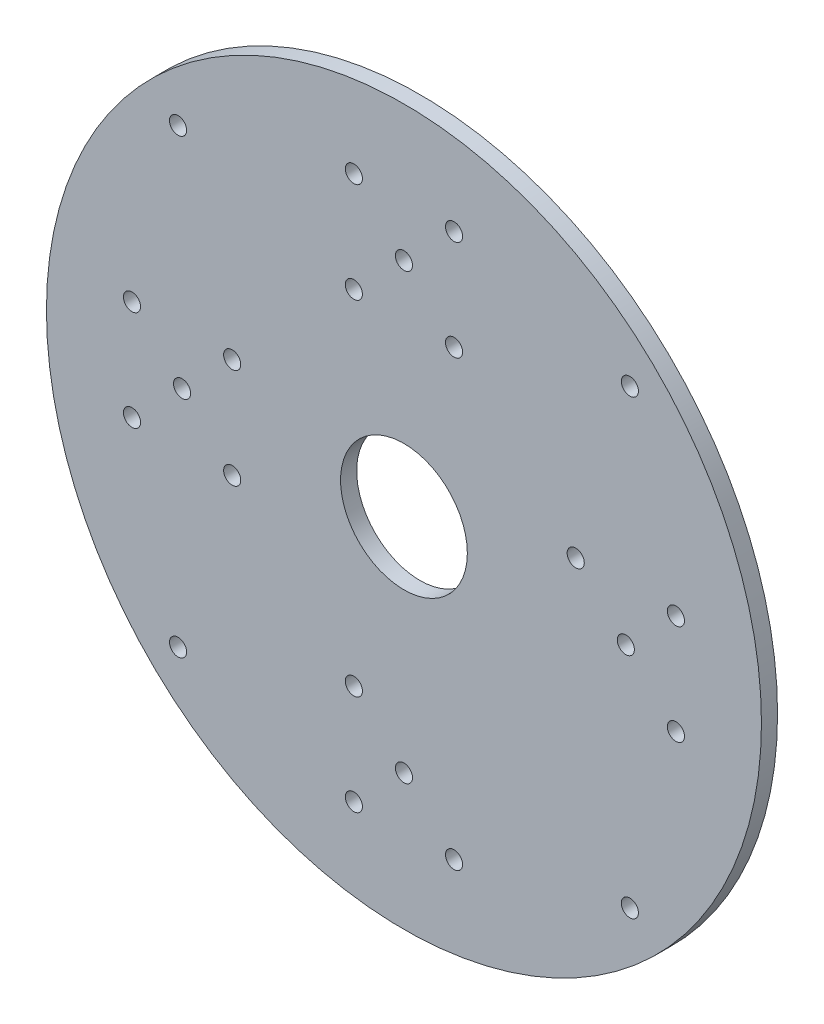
from build123d import *

# Parameters (mm, degrees)
SKETCH1_R           = 141
SKETCH1_R_2         = 3.3782
SKETCH1_R_3         = 25
BOSS_EXTRUDE1_DEPTH = 6.35


with BuildPart() as part:
    # Sketch1 → Boss-Extrude1 (new body)
    with BuildSketch(Plane(origin=(0, 0, 0), x_dir=(0, 1, 0), z_dir=(0, 0, 1))):
        with Locations(Location((0, 0, 0), (0, 0, 270))):
            Circle(SKETCH1_R)
        with Locations(Location((0, 87.5, 0), (0, 0, 270))):
            Circle(SKETCH1_R_2, mode=Mode.SUBTRACT)
        with Locations(Location((87.5, 0, 0), (0, 0, 270))):
            Circle(SKETCH1_R_2, mode=Mode.SUBTRACT)
        with Locations(Location((0, -87.5, 0), (0, 0, 270))):
            Circle(SKETCH1_R_2, mode=Mode.SUBTRACT)
        with Locations(Location((-87.5, 0, 0), (0, 0, 270))):
            Circle(SKETCH1_R_2, mode=Mode.SUBTRACT)
        with Locations(Location((-89.09545443, 89.09545443, 0), (0, 0, 270))):
            Circle(SKETCH1_R_2, mode=Mode.SUBTRACT)
        with Locations(Location((89.09545443, 89.09545443, 0), (0, 0, 270))):
            Circle(SKETCH1_R_2, mode=Mode.SUBTRACT)
        with Locations(Location((89.09545443, -89.09545443, 0), (0, 0, 270))):
            Circle(SKETCH1_R_2, mode=Mode.SUBTRACT)
        with Locations(Location((-89.09545443, -89.09545443, 0), (0, 0, 270))):
            Circle(SKETCH1_R_2, mode=Mode.SUBTRACT)
        with Locations(Location((0, 0, 0), (0, 0, 270))):
            Circle(SKETCH1_R_3, mode=Mode.SUBTRACT)
        with Locations(Location((-19.756563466, 67.743436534, 0), (0, 0, 270))):
            Circle(SKETCH1_R_2, mode=Mode.SUBTRACT)
        with Locations(Location((-19.756563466, 107.256563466, 0), (0, 0, 270))):
            Circle(SKETCH1_R_2, mode=Mode.SUBTRACT)
        with Locations(Location((19.756563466, 107.256563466, 0), (0, 0, 270))):
            Circle(SKETCH1_R_2, mode=Mode.SUBTRACT)
        with Locations(Location((19.756563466, 67.743436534, 0), (0, 0, 270))):
            Circle(SKETCH1_R_2, mode=Mode.SUBTRACT)
        with Locations(Location((107.256563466, 19.756563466, 0), (0, 0, 270))):
            Circle(SKETCH1_R_2, mode=Mode.SUBTRACT)
        with Locations(Location((107.256563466, -19.756563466, 0), (0, 0, 270))):
            Circle(SKETCH1_R_2, mode=Mode.SUBTRACT)
        with Locations(Location((67.743436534, -19.756563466, 0), (0, 0, 270))):
            Circle(SKETCH1_R_2, mode=Mode.SUBTRACT)
        with Locations(Location((67.743436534, 19.756563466, 0), (0, 0, 270))):
            Circle(SKETCH1_R_2, mode=Mode.SUBTRACT)
        with Locations(Location((19.756563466, -67.743436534, 0), (0, 0, 270))):
            Circle(SKETCH1_R_2, mode=Mode.SUBTRACT)
        with Locations(Location((19.756563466, -107.256563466, 0), (0, 0, 270))):
            Circle(SKETCH1_R_2, mode=Mode.SUBTRACT)
        with Locations(Location((-19.756563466, -107.256563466, 0), (0, 0, 270))):
            Circle(SKETCH1_R_2, mode=Mode.SUBTRACT)
        with Locations(Location((-107.256563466, -19.756563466, 0), (0, 0, 270))):
            Circle(SKETCH1_R_2, mode=Mode.SUBTRACT)
        with Locations(Location((-107.256563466, 19.756563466, 0), (0, 0, 270))):
            Circle(SKETCH1_R_2, mode=Mode.SUBTRACT)
        with Locations(Location((-67.743436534, 19.756563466, 0), (0, 0, 270))):
            Circle(SKETCH1_R_2, mode=Mode.SUBTRACT)
    extrude(amount=BOSS_EXTRUDE1_DEPTH)


solid = part.part
